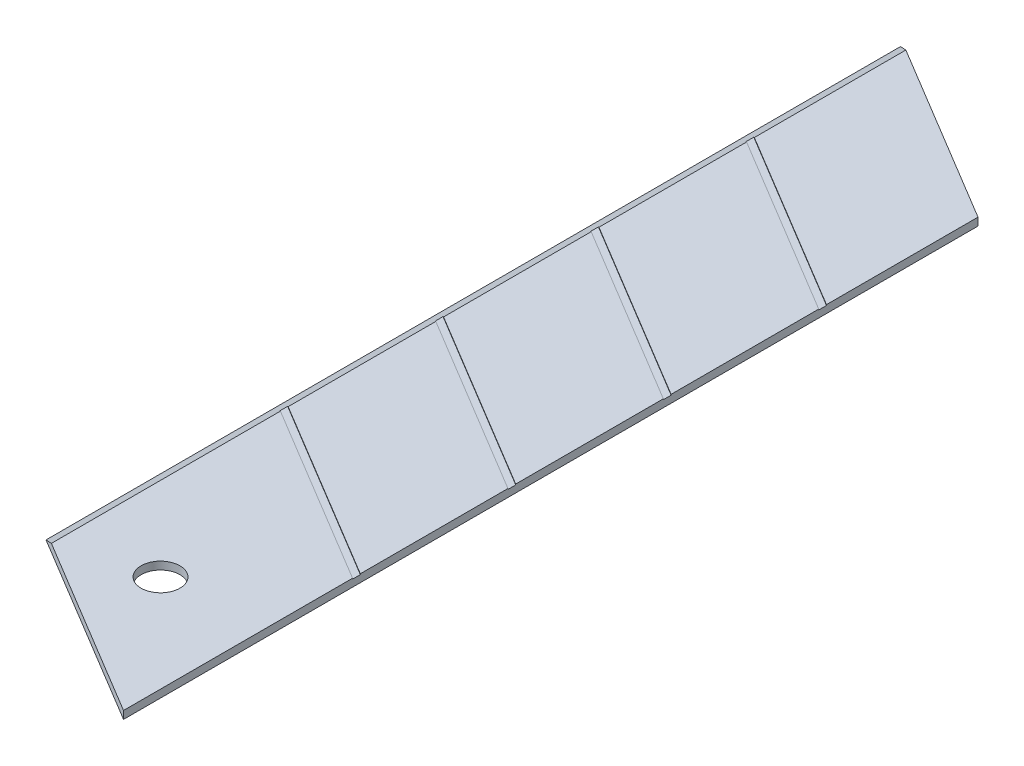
ISO-10303-21;
HEADER;
FILE_DESCRIPTION(('STEP AP214'),'2;1');
FILE_NAME('part.step','',(''),(''),'','','');
FILE_SCHEMA(('AUTOMOTIVE_DESIGN { 1 0 10303 214 1 1 1 1 }'));
ENDSEC;
DATA;
#1=APPLICATION_CONTEXT('core data for automotive mechanical design processes');
#2=APPLICATION_PROTOCOL_DEFINITION('international standard','automotive_design',2000,#1);
#3=PRODUCT_CONTEXT('',#1,'mechanical');
#4=PRODUCT('Part','Part','',(#3));
#5=PRODUCT_RELATED_PRODUCT_CATEGORY('part','',(#4));
#6=PRODUCT_DEFINITION_FORMATION('','',#4);
#7=PRODUCT_DEFINITION_CONTEXT('part definition',#1,'design');
#8=PRODUCT_DEFINITION('design','',#6,#7);
#9=PRODUCT_DEFINITION_SHAPE('','',#8);
#10=(LENGTH_UNIT() NAMED_UNIT(*) SI_UNIT(.MILLI.,.METRE.));
#11=(NAMED_UNIT(*) PLANE_ANGLE_UNIT() SI_UNIT($,.RADIAN.));
#12=(NAMED_UNIT(*) SI_UNIT($,.STERADIAN.) SOLID_ANGLE_UNIT());
#13=UNCERTAINTY_MEASURE_WITH_UNIT(LENGTH_MEASURE(1.E-05),#10,'distance_accuracy_value','');
#14=(GEOMETRIC_REPRESENTATION_CONTEXT(3) GLOBAL_UNCERTAINTY_ASSIGNED_CONTEXT((#13)) GLOBAL_UNIT_ASSIGNED_CONTEXT((#10,
#11,#12)) REPRESENTATION_CONTEXT('',''));
#15=CARTESIAN_POINT('',(0.,0.,0.));
#16=DIRECTION('',(0.,0.,1.));
#17=DIRECTION('',(1.,0.,0.));
#18=AXIS2_PLACEMENT_3D('',#15,#16,#17);
#19=CARTESIAN_POINT('',(12.5,-1.,7.51075773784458));
#20=DIRECTION('',(1.,0.,0.));
#21=DIRECTION('',(0.,0.,-1.));
#22=AXIS2_PLACEMENT_3D('',#19,#20,#21);
#23=PLANE('',#22);
#24=DIRECTION('',(0.,0.,-1.));
#25=VECTOR('',#24,1.);
#26=CARTESIAN_POINT('',(12.5,0.,7.51075773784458));
#27=LINE('',#26,#25);
#28=CARTESIAN_POINT('',(12.5,0.,-22.9677267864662));
#29=VERTEX_POINT('',#28);
#30=CARTESIAN_POINT('',(12.5,0.,-41.9677267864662));
#31=VERTEX_POINT('',#30);
#32=EDGE_CURVE('E270',#29,#31,#27,.T.);
#33=ORIENTED_EDGE('',*,*,#32,.F.);
#34=DIRECTION('',(0.,1.,0.));
#35=VECTOR('',#34,1.);
#36=CARTESIAN_POINT('',(12.5,-0.1,-22.9677267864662));
#37=LINE('',#36,#35);
#38=CARTESIAN_POINT('',(12.5,-0.1,-22.9677267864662));
#39=VERTEX_POINT('',#38);
#40=EDGE_CURVE('E187',#39,#29,#37,.T.);
#41=ORIENTED_EDGE('',*,*,#40,.F.);
#42=DIRECTION('',(0.,0.,-1.));
#43=VECTOR('',#42,1.);
#44=CARTESIAN_POINT('',(12.5,-0.1,0.));
#45=LINE('',#44,#43);
#46=CARTESIAN_POINT('',(12.5,-0.1,-21.9677267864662));
#47=VERTEX_POINT('',#46);
#48=EDGE_CURVE('E173',#47,#39,#45,.T.);
#49=ORIENTED_EDGE('',*,*,#48,.F.);
#50=DIRECTION('',(0.,1.,0.));
#51=VECTOR('',#50,1.);
#52=CARTESIAN_POINT('',(12.5,-0.1,-21.9677267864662));
#53=LINE('',#52,#51);
#54=CARTESIAN_POINT('',(12.5,0.,-21.9677267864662));
#55=VERTEX_POINT('',#54);
#56=EDGE_CURVE('E180',#47,#55,#53,.T.);
#57=ORIENTED_EDGE('',*,*,#56,.T.);
#58=CARTESIAN_POINT('',(12.5,0.,7.51075773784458));
#59=VERTEX_POINT('',#58);
#60=EDGE_CURVE('E268',#59,#55,#27,.T.);
#61=ORIENTED_EDGE('',*,*,#60,.F.);
#62=DIRECTION('',(0.,1.,0.));
#63=VECTOR('',#62,1.);
#64=CARTESIAN_POINT('',(12.5,-1.,7.51075773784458));
#65=LINE('',#64,#63);
#66=CARTESIAN_POINT('',(12.5,-1.,7.51075773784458));
#67=VERTEX_POINT('',#66);
#68=EDGE_CURVE('E265',#67,#59,#65,.T.);
#69=ORIENTED_EDGE('',*,*,#68,.F.);
#70=DIRECTION('',(0.,0.,-1.));
#71=VECTOR('',#70,1.);
#72=CARTESIAN_POINT('',(12.5,-1.,7.51075773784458));
#73=LINE('',#72,#71);
#74=CARTESIAN_POINT('',(12.5,-1.,-102.467726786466));
#75=VERTEX_POINT('',#74);
#76=EDGE_CURVE('E259',#67,#75,#73,.T.);
#77=ORIENTED_EDGE('',*,*,#76,.T.);
#78=DIRECTION('',(0.,1.,0.));
#79=VECTOR('',#78,1.);
#80=CARTESIAN_POINT('',(12.5,-1.,-102.467726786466));
#81=LINE('',#80,#79);
#82=CARTESIAN_POINT('',(12.5,0.,-102.467726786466));
#83=VERTEX_POINT('',#82);
#84=EDGE_CURVE('E274',#75,#83,#81,.T.);
#85=ORIENTED_EDGE('',*,*,#84,.T.);
#86=CARTESIAN_POINT('',(12.5,0.,-82.9677267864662));
#87=VERTEX_POINT('',#86);
#88=EDGE_CURVE('E267',#87,#83,#27,.T.);
#89=ORIENTED_EDGE('',*,*,#88,.F.);
#90=DIRECTION('',(0.,1.,0.));
#91=VECTOR('',#90,1.);
#92=CARTESIAN_POINT('',(12.5,-0.1,-82.9677267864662));
#93=LINE('',#92,#91);
#94=CARTESIAN_POINT('',(12.5,-0.1,-82.9677267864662));
#95=VERTEX_POINT('',#94);
#96=EDGE_CURVE('E212',#95,#87,#93,.T.);
#97=ORIENTED_EDGE('',*,*,#96,.F.);
#98=DIRECTION('',(0.,0.,-1.));
#99=VECTOR('',#98,1.);
#100=CARTESIAN_POINT('',(12.5,-0.1,0.));
#101=LINE('',#100,#99);
#102=CARTESIAN_POINT('',(12.5,-0.1,-81.9677267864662));
#103=VERTEX_POINT('',#102);
#104=EDGE_CURVE('E206',#103,#95,#101,.T.);
#105=ORIENTED_EDGE('',*,*,#104,.F.);
#106=DIRECTION('',(0.,1.,0.));
#107=VECTOR('',#106,1.);
#108=CARTESIAN_POINT('',(12.5,-0.1,-81.9677267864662));
#109=LINE('',#108,#107);
#110=CARTESIAN_POINT('',(12.5,0.,-81.9677267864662));
#111=VERTEX_POINT('',#110);
#112=EDGE_CURVE('E209',#103,#111,#109,.T.);
#113=ORIENTED_EDGE('',*,*,#112,.T.);
#114=CARTESIAN_POINT('',(12.5,0.,-62.9677267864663));
#115=VERTEX_POINT('',#114);
#116=EDGE_CURVE('E340',#115,#111,#27,.T.);
#117=ORIENTED_EDGE('',*,*,#116,.F.);
#118=DIRECTION('',(0.,1.,0.));
#119=VECTOR('',#118,1.);
#120=CARTESIAN_POINT('',(12.5,-0.1,-62.9677267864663));
#121=LINE('',#120,#119);
#122=CARTESIAN_POINT('',(12.5,-0.1,-62.9677267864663));
#123=VERTEX_POINT('',#122);
#124=EDGE_CURVE('E229',#123,#115,#121,.T.);
#125=ORIENTED_EDGE('',*,*,#124,.F.);
#126=DIRECTION('',(0.,0.,-1.));
#127=VECTOR('',#126,1.);
#128=CARTESIAN_POINT('',(12.5,-0.1,0.));
#129=LINE('',#128,#127);
#130=CARTESIAN_POINT('',(12.5,-0.1,-61.9677267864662));
#131=VERTEX_POINT('',#130);
#132=EDGE_CURVE('E220',#131,#123,#129,.T.);
#133=ORIENTED_EDGE('',*,*,#132,.F.);
#134=DIRECTION('',(0.,1.,0.));
#135=VECTOR('',#134,1.);
#136=CARTESIAN_POINT('',(12.5,-0.1,-61.9677267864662));
#137=LINE('',#136,#135);
#138=CARTESIAN_POINT('',(12.5,0.,-61.9677267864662));
#139=VERTEX_POINT('',#138);
#140=EDGE_CURVE('E226',#131,#139,#137,.T.);
#141=ORIENTED_EDGE('',*,*,#140,.T.);
#142=CARTESIAN_POINT('',(12.5,0.,-42.9677267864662));
#143=VERTEX_POINT('',#142);
#144=EDGE_CURVE('E271',#143,#139,#27,.T.);
#145=ORIENTED_EDGE('',*,*,#144,.F.);
#146=DIRECTION('',(0.,1.,0.));
#147=VECTOR('',#146,1.);
#148=CARTESIAN_POINT('',(12.5,-0.1,-42.9677267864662));
#149=LINE('',#148,#147);
#150=CARTESIAN_POINT('',(12.5,-0.1,-42.9677267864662));
#151=VERTEX_POINT('',#150);
#152=EDGE_CURVE('E246',#151,#143,#149,.T.);
#153=ORIENTED_EDGE('',*,*,#152,.F.);
#154=DIRECTION('',(0.,0.,-1.));
#155=VECTOR('',#154,1.);
#156=CARTESIAN_POINT('',(12.5,-0.1,0.));
#157=LINE('',#156,#155);
#158=CARTESIAN_POINT('',(12.5,-0.1,-41.9677267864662));
#159=VERTEX_POINT('',#158);
#160=EDGE_CURVE('E237',#159,#151,#157,.T.);
#161=ORIENTED_EDGE('',*,*,#160,.F.);
#162=DIRECTION('',(0.,1.,0.));
#163=VECTOR('',#162,1.);
#164=CARTESIAN_POINT('',(12.5,-0.1,-41.9677267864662));
#165=LINE('',#164,#163);
#166=EDGE_CURVE('E243',#159,#31,#165,.T.);
#167=ORIENTED_EDGE('',*,*,#166,.T.);
#168=EDGE_LOOP('',(#33,#41,#49,#57,#61,#69,#77,#85,#89,#97,#105,#113,#117,#125,#133,#141,#145,
#153,#161,#167));
#169=FACE_BOUND('',#168,.T.);
#170=ADVANCED_FACE('F35',(#169),#23,.T.);
#171=CARTESIAN_POINT('',(0.,0.,0.));
#172=DIRECTION('',(0.,-1.,0.));
#173=DIRECTION('',(0.,0.,-1.));
#174=AXIS2_PLACEMENT_3D('',#171,#172,#173);
#175=PLANE('',#174);
#176=DIRECTION('',(0.85716730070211,0.,0.515038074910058));
#177=VECTOR('',#176,1.);
#178=CARTESIAN_POINT('',(21.8434544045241,0.,-36.3536129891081));
#179=LINE('',#178,#177);
#180=CARTESIAN_POINT('',(-10.7679491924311,0.,-55.9485211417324));
#181=VERTEX_POINT('',#180);
#182=EDGE_CURVE('E232',#181,#31,#179,.T.);
#183=ORIENTED_EDGE('',*,*,#182,.F.);
#184=DIRECTION('',(0.,0.,1.));
#185=VECTOR('',#184,1.);
#186=CARTESIAN_POINT('',(-10.7679491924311,0.,0.));
#187=LINE('',#186,#185);
#188=CARTESIAN_POINT('',(-10.7679491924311,0.,-36.9485211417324));
#189=VERTEX_POINT('',#188);
#190=EDGE_CURVE('E310',#181,#189,#187,.T.);
#191=ORIENTED_EDGE('',*,*,#190,.T.);
#192=DIRECTION('',(0.85716730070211,0.,0.515038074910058));
#193=VECTOR('',#192,1.);
#194=CARTESIAN_POINT('',(13.4554522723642,0.,-22.3936331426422));
#195=LINE('',#194,#193);
#196=EDGE_CURVE('E177',#189,#29,#195,.T.);
#197=ORIENTED_EDGE('',*,*,#196,.T.);
#198=ORIENTED_EDGE('',*,*,#32,.T.);
#199=EDGE_LOOP('',(#183,#191,#197,#198));
#200=FACE_BOUND('',#199,.T.);
#201=ADVANCED_FACE('F315',(#200),#175,.F.);
#202=DIRECTION('',(-0.85716730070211,0.,-0.515038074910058));
#203=VECTOR('',#202,1.);
#204=CARTESIAN_POINT('',(-12.5,0.,-117.489242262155));
#205=LINE('',#204,#203);
#206=CARTESIAN_POINT('',(-10.7679491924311,0.,-116.448521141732));
#207=VERTEX_POINT('',#206);
#208=EDGE_CURVE('E256',#83,#207,#205,.T.);
#209=ORIENTED_EDGE('',*,*,#208,.T.);
#210=DIRECTION('',(0.,0.,1.));
#211=VECTOR('',#210,1.);
#212=CARTESIAN_POINT('',(-10.7679491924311,0.,0.));
#213=LINE('',#212,#211);
#214=CARTESIAN_POINT('',(-10.7679491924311,0.,-96.9485211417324));
#215=VERTEX_POINT('',#214);
#216=EDGE_CURVE('E286',#207,#215,#213,.T.);
#217=ORIENTED_EDGE('',*,*,#216,.T.);
#218=DIRECTION('',(0.85716730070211,0.,0.515038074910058));
#219=VECTOR('',#218,1.);
#220=CARTESIAN_POINT('',(39.9438800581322,0.,-66.4777800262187));
#221=LINE('',#220,#219);
#222=EDGE_CURVE('E199',#215,#87,#221,.T.);
#223=ORIENTED_EDGE('',*,*,#222,.T.);
#224=ORIENTED_EDGE('',*,*,#88,.T.);
#225=EDGE_LOOP('',(#209,#217,#223,#224));
#226=FACE_BOUND('',#225,.T.);
#227=ADVANCED_FACE('F386',(#226),#175,.F.);
#228=DIRECTION('',(0.85716730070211,0.,0.515038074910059));
#229=VECTOR('',#228,1.);
#230=CARTESIAN_POINT('',(39.5024062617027,0.,-65.7430442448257));
#231=LINE('',#230,#229);
#232=CARTESIAN_POINT('',(-10.7679491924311,0.,-95.9485211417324));
#233=VERTEX_POINT('',#232);
#234=EDGE_CURVE('E204',#233,#111,#231,.T.);
#235=ORIENTED_EDGE('',*,*,#234,.F.);
#236=DIRECTION('',(0.,0.,1.));
#237=VECTOR('',#236,1.);
#238=CARTESIAN_POINT('',(-10.7679491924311,0.,0.));
#239=LINE('',#238,#237);
#240=CARTESIAN_POINT('',(-10.7679491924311,0.,-76.9485211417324));
#241=VERTEX_POINT('',#240);
#242=EDGE_CURVE('E294',#233,#241,#239,.T.);
#243=ORIENTED_EDGE('',*,*,#242,.T.);
#244=DIRECTION('',(0.85716730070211,0.,0.515038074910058));
#245=VECTOR('',#244,1.);
#246=CARTESIAN_POINT('',(31.1144041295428,0.,-51.7830643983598));
#247=LINE('',#246,#245);
#248=EDGE_CURVE('E221',#241,#115,#247,.T.);
#249=ORIENTED_EDGE('',*,*,#248,.T.);
#250=ORIENTED_EDGE('',*,*,#116,.T.);
#251=EDGE_LOOP('',(#235,#243,#249,#250));
#252=FACE_BOUND('',#251,.T.);
#253=ADVANCED_FACE('F398',(#252),#175,.F.);
#254=DIRECTION('',(0.85716730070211,0.,0.515038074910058));
#255=VECTOR('',#254,1.);
#256=CARTESIAN_POINT('',(30.6729303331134,0.,-51.0483286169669));
#257=LINE('',#256,#255);
#258=CARTESIAN_POINT('',(-10.7679491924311,0.,-75.9485211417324));
#259=VERTEX_POINT('',#258);
#260=EDGE_CURVE('E215',#259,#139,#257,.T.);
#261=ORIENTED_EDGE('',*,*,#260,.F.);
#262=DIRECTION('',(0.,0.,1.));
#263=VECTOR('',#262,1.);
#264=CARTESIAN_POINT('',(-10.7679491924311,0.,0.));
#265=LINE('',#264,#263);
#266=CARTESIAN_POINT('',(-10.7679491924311,0.,-56.9485211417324));
#267=VERTEX_POINT('',#266);
#268=EDGE_CURVE('E302',#259,#267,#265,.T.);
#269=ORIENTED_EDGE('',*,*,#268,.T.);
#270=DIRECTION('',(0.85716730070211,0.,0.515038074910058));
#271=VECTOR('',#270,1.);
#272=CARTESIAN_POINT('',(22.2849282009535,0.,-37.088348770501));
#273=LINE('',#272,#271);
#274=EDGE_CURVE('E238',#267,#143,#273,.T.);
#275=ORIENTED_EDGE('',*,*,#274,.T.);
#276=ORIENTED_EDGE('',*,*,#144,.T.);
#277=EDGE_LOOP('',(#261,#269,#275,#276));
#278=FACE_BOUND('',#277,.T.);
#279=ADVANCED_FACE('F346',(#278),#175,.F.);
#280=CARTESIAN_POINT('',(-12.5,-1.,-117.489242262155));
#281=DIRECTION('',(0.515038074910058,0.,-0.85716730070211));
#282=DIRECTION('',(-0.85716730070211,0.,-0.515038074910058));
#283=AXIS2_PLACEMENT_3D('',#280,#281,#282);
#284=PLANE('',#283);
#285=DIRECTION('',(-0.85716730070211,0.,-0.515038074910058));
#286=VECTOR('',#285,1.);
#287=CARTESIAN_POINT('',(-12.5,-1.,-117.489242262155));
#288=LINE('',#287,#286);
#289=CARTESIAN_POINT('',(-12.5,-1.,-117.489242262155));
#290=VERTEX_POINT('',#289);
#291=EDGE_CURVE('E262',#75,#290,#288,.T.);
#292=ORIENTED_EDGE('',*,*,#291,.T.);
#293=DIRECTION('',(0.768238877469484,0.443542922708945,0.461604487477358));
#294=VECTOR('',#293,1.);
#295=CARTESIAN_POINT('',(-12.5,-1.,-117.489242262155));
#296=LINE('',#295,#294);
#297=EDGE_CURVE('E284',#290,#207,#296,.T.);
#298=ORIENTED_EDGE('',*,*,#297,.T.);
#299=ORIENTED_EDGE('',*,*,#208,.F.);
#300=ORIENTED_EDGE('',*,*,#84,.F.);
#301=EDGE_LOOP('',(#292,#298,#299,#300));
#302=FACE_BOUND('',#301,.T.);
#303=ADVANCED_FACE('F334',(#302),#284,.T.);
#304=CARTESIAN_POINT('',(-12.5,-1.,-7.51075773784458));
#305=DIRECTION('',(-0.515038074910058,0.,0.85716730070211));
#306=DIRECTION('',(0.85716730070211,0.,0.515038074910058));
#307=AXIS2_PLACEMENT_3D('',#304,#305,#306);
#308=PLANE('',#307);
#309=DIRECTION('',(0.85716730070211,0.,0.515038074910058));
#310=VECTOR('',#309,1.);
#311=CARTESIAN_POINT('',(-12.5,0.,-7.51075773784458));
#312=LINE('',#311,#310);
#313=CARTESIAN_POINT('',(-10.7679491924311,0.,-6.47003661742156));
#314=VERTEX_POINT('',#313);
#315=EDGE_CURVE('E249',#314,#59,#312,.T.);
#316=ORIENTED_EDGE('',*,*,#315,.F.);
#317=DIRECTION('',(-0.768238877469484,-0.443542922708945,-0.461604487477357));
#318=VECTOR('',#317,1.);
#319=CARTESIAN_POINT('',(-12.5,-1.,-7.51075773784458));
#320=LINE('',#319,#318);
#321=CARTESIAN_POINT('',(-12.5,-1.,-7.51075773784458));
#322=VERTEX_POINT('',#321);
#323=EDGE_CURVE('E282',#314,#322,#320,.T.);
#324=ORIENTED_EDGE('',*,*,#323,.T.);
#325=DIRECTION('',(0.85716730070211,0.,0.515038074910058));
#326=VECTOR('',#325,1.);
#327=CARTESIAN_POINT('',(-12.5,-1.,-7.51075773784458));
#328=LINE('',#327,#326);
#329=EDGE_CURVE('E255',#322,#67,#328,.T.);
#330=ORIENTED_EDGE('',*,*,#329,.T.);
#331=ORIENTED_EDGE('',*,*,#68,.T.);
#332=EDGE_LOOP('',(#316,#324,#330,#331));
#333=FACE_BOUND('',#332,.T.);
#334=ADVANCED_FACE('F331',(#333),#308,.T.);
#335=CARTESIAN_POINT('',(0.,-1.,0.));
#336=DIRECTION('',(0.,-1.,0.));
#337=DIRECTION('',(0.,0.,-1.));
#338=AXIS2_PLACEMENT_3D('',#335,#336,#337);
#339=PLANE('',#338);
#340=CARTESIAN_POINT('',(0.,-1.,-9.75));
#341=DIRECTION('',(0.,1.,0.));
#342=DIRECTION('',(0.,0.,1.));
#343=AXIS2_PLACEMENT_3D('',#340,#341,#342);
#344=CIRCLE('',#343,2.5);
#345=CARTESIAN_POINT('',(0.,-1.,-7.25));
#346=VERTEX_POINT('',#345);
#347=EDGE_CURVE('E197',#346,#346,#344,.T.);
#348=ORIENTED_EDGE('',*,*,#347,.T.);
#349=EDGE_LOOP('',(#348));
#350=FACE_BOUND('',#349,.T.);
#351=DIRECTION('',(0.,0.,1.));
#352=VECTOR('',#351,1.);
#353=CARTESIAN_POINT('',(-12.5,-1.,-7.51075773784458));
#354=LINE('',#353,#352);
#355=EDGE_CURVE('E252',#290,#322,#354,.T.);
#356=ORIENTED_EDGE('',*,*,#355,.F.);
#357=ORIENTED_EDGE('',*,*,#291,.F.);
#358=ORIENTED_EDGE('',*,*,#76,.F.);
#359=ORIENTED_EDGE('',*,*,#329,.F.);
#360=EDGE_LOOP('',(#356,#357,#358,#359));
#361=FACE_BOUND('',#360,.T.);
#362=ADVANCED_FACE('F330',(#350,#361),#339,.T.);
#363=CARTESIAN_POINT('',(0.,0.,-9.75));
#364=DIRECTION('',(0.,1.,0.));
#365=DIRECTION('',(0.,0.,1.));
#366=AXIS2_PLACEMENT_3D('',#363,#364,#365);
#367=CIRCLE('',#366,2.5);
#368=CARTESIAN_POINT('',(0.,0.,-7.25));
#369=VERTEX_POINT('',#368);
#370=EDGE_CURVE('E409',#369,#369,#367,.T.);
#371=ORIENTED_EDGE('',*,*,#370,.F.);
#372=EDGE_LOOP('',(#371));
#373=FACE_BOUND('',#372,.T.);
#374=DIRECTION('',(0.85716730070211,0.,0.515038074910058));
#375=VECTOR('',#374,1.);
#376=CARTESIAN_POINT('',(13.0139784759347,0.,-21.6588973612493));
#377=LINE('',#376,#375);
#378=CARTESIAN_POINT('',(-10.7679491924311,0.,-35.9485211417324));
#379=VERTEX_POINT('',#378);
#380=EDGE_CURVE('E183',#379,#55,#377,.T.);
#381=ORIENTED_EDGE('',*,*,#380,.F.);
#382=DIRECTION('',(0.,0.,1.));
#383=VECTOR('',#382,1.);
#384=CARTESIAN_POINT('',(-10.7679491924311,0.,-7.51075773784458));
#385=LINE('',#384,#383);
#386=EDGE_CURVE('E277',#379,#314,#385,.T.);
#387=ORIENTED_EDGE('',*,*,#386,.T.);
#388=ORIENTED_EDGE('',*,*,#315,.T.);
#389=ORIENTED_EDGE('',*,*,#60,.T.);
#390=EDGE_LOOP('',(#381,#387,#388,#389));
#391=FACE_BOUND('',#390,.T.);
#392=ADVANCED_FACE('F323',(#373,#391),#175,.F.);
#393=CARTESIAN_POINT('',(22.2849282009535,-0.1,-37.088348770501));
#394=DIRECTION('',(-0.515038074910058,0.,0.85716730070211));
#395=DIRECTION('',(0.85716730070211,0.,0.515038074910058));
#396=AXIS2_PLACEMENT_3D('',#393,#394,#395);
#397=PLANE('',#396);
#398=ORIENTED_EDGE('',*,*,#274,.F.);
#399=DIRECTION('',(-0.768238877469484,-0.443542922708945,-0.461604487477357));
#400=VECTOR('',#399,1.);
#401=CARTESIAN_POINT('',(15.7483502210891,15.3091926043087,-41.0159210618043));
#402=LINE('',#401,#400);
#403=CARTESIAN_POINT('',(-10.941154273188,-0.1,-57.0525932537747));
#404=VERTEX_POINT('',#403);
#405=EDGE_CURVE('E304',#267,#404,#402,.T.);
#406=ORIENTED_EDGE('',*,*,#405,.T.);
#407=DIRECTION('',(0.85716730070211,0.,0.515038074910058));
#408=VECTOR('',#407,1.);
#409=CARTESIAN_POINT('',(22.2849282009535,-0.1,-37.088348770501));
#410=LINE('',#409,#408);
#411=EDGE_CURVE('E241',#404,#151,#410,.T.);
#412=ORIENTED_EDGE('',*,*,#411,.T.);
#413=ORIENTED_EDGE('',*,*,#152,.T.);
#414=EDGE_LOOP('',(#398,#406,#412,#413));
#415=FACE_BOUND('',#414,.T.);
#416=ADVANCED_FACE('F363',(#415),#397,.T.);
#417=CARTESIAN_POINT('',(21.8434544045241,-0.1,-36.3536129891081));
#418=DIRECTION('',(-0.515038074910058,0.,0.85716730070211));
#419=DIRECTION('',(0.85716730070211,0.,0.515038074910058));
#420=AXIS2_PLACEMENT_3D('',#417,#418,#419);
#421=PLANE('',#420);
#422=DIRECTION('',(0.85716730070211,0.,0.515038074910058));
#423=VECTOR('',#422,1.);
#424=CARTESIAN_POINT('',(21.8434544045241,-0.1,-36.3536129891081));
#425=LINE('',#424,#423);
#426=CARTESIAN_POINT('',(-10.941154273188,-0.0999999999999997,-56.0525932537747));
#427=VERTEX_POINT('',#426);
#428=EDGE_CURVE('E235',#427,#159,#425,.T.);
#429=ORIENTED_EDGE('',*,*,#428,.F.);
#430=DIRECTION('',(0.768238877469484,0.443542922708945,0.461604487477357));
#431=VECTOR('',#430,1.);
#432=CARTESIAN_POINT('',(9.07265598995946,11.4549787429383,-44.0270828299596));
#433=LINE('',#432,#431);
#434=EDGE_CURVE('E308',#427,#181,#433,.T.);
#435=ORIENTED_EDGE('',*,*,#434,.T.);
#436=ORIENTED_EDGE('',*,*,#182,.T.);
#437=ORIENTED_EDGE('',*,*,#166,.F.);
#438=EDGE_LOOP('',(#429,#435,#436,#437));
#439=FACE_BOUND('',#438,.T.);
#440=ADVANCED_FACE('F370',(#439),#421,.F.);
#441=CARTESIAN_POINT('',(0.,-0.1,0.));
#442=DIRECTION('',(0.,1.,0.));
#443=DIRECTION('',(0.,0.,1.));
#444=AXIS2_PLACEMENT_3D('',#441,#442,#443);
#445=PLANE('',#444);
#446=ORIENTED_EDGE('',*,*,#411,.F.);
#447=DIRECTION('',(0.,0.,1.));
#448=VECTOR('',#447,1.);
#449=CARTESIAN_POINT('',(-10.941154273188,-0.1,0.));
#450=LINE('',#449,#448);
#451=EDGE_CURVE('E306',#404,#427,#450,.T.);
#452=ORIENTED_EDGE('',*,*,#451,.T.);
#453=ORIENTED_EDGE('',*,*,#428,.T.);
#454=ORIENTED_EDGE('',*,*,#160,.T.);
#455=EDGE_LOOP('',(#446,#452,#453,#454));
#456=FACE_BOUND('',#455,.T.);
#457=ADVANCED_FACE('F366',(#456),#445,.T.);
#458=CARTESIAN_POINT('',(31.1144041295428,-0.1,-51.7830643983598));
#459=DIRECTION('',(-0.515038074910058,0.,0.85716730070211));
#460=DIRECTION('',(0.85716730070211,0.,0.515038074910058));
#461=AXIS2_PLACEMENT_3D('',#458,#459,#460);
#462=PLANE('',#461);
#463=ORIENTED_EDGE('',*,*,#248,.F.);
#464=DIRECTION('',(-0.768238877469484,-0.443542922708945,-0.461604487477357));
#465=VECTOR('',#464,1.);
#466=CARTESIAN_POINT('',(22.8408004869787,19.4040206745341,-56.7543470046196));
#467=LINE('',#466,#465);
#468=CARTESIAN_POINT('',(-10.941154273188,-0.1,-77.0525932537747));
#469=VERTEX_POINT('',#468);
#470=EDGE_CURVE('E296',#241,#469,#467,.T.);
#471=ORIENTED_EDGE('',*,*,#470,.T.);
#472=DIRECTION('',(0.85716730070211,0.,0.515038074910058));
#473=VECTOR('',#472,1.);
#474=CARTESIAN_POINT('',(31.1144041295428,-0.1,-51.7830643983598));
#475=LINE('',#474,#473);
#476=EDGE_CURVE('E224',#469,#123,#475,.T.);
#477=ORIENTED_EDGE('',*,*,#476,.T.);
#478=ORIENTED_EDGE('',*,*,#124,.T.);
#479=EDGE_LOOP('',(#463,#471,#477,#478));
#480=FACE_BOUND('',#479,.T.);
#481=ADVANCED_FACE('F377',(#480),#462,.T.);
#482=CARTESIAN_POINT('',(30.6729303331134,-0.1,-51.0483286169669));
#483=DIRECTION('',(-0.515038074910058,0.,0.85716730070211));
#484=DIRECTION('',(0.85716730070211,0.,0.515038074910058));
#485=AXIS2_PLACEMENT_3D('',#482,#483,#484);
#486=PLANE('',#485);
#487=DIRECTION('',(0.85716730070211,0.,0.515038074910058));
#488=VECTOR('',#487,1.);
#489=CARTESIAN_POINT('',(30.6729303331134,-0.1,-51.0483286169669));
#490=LINE('',#489,#488);
#491=CARTESIAN_POINT('',(-10.941154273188,-0.100000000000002,-76.0525932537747));
#492=VERTEX_POINT('',#491);
#493=EDGE_CURVE('E218',#492,#131,#490,.T.);
#494=ORIENTED_EDGE('',*,*,#493,.F.);
#495=DIRECTION('',(0.768238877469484,0.443542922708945,0.461604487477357));
#496=VECTOR('',#495,1.);
#497=CARTESIAN_POINT('',(16.1651062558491,15.5498068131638,-59.7655087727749));
#498=LINE('',#497,#496);
#499=EDGE_CURVE('E300',#492,#259,#498,.T.);
#500=ORIENTED_EDGE('',*,*,#499,.T.);
#501=ORIENTED_EDGE('',*,*,#260,.T.);
#502=ORIENTED_EDGE('',*,*,#140,.F.);
#503=EDGE_LOOP('',(#494,#500,#501,#502));
#504=FACE_BOUND('',#503,.T.);
#505=ADVANCED_FACE('F356',(#504),#486,.F.);
#506=CARTESIAN_POINT('',(0.,-0.1,0.));
#507=DIRECTION('',(0.,1.,0.));
#508=DIRECTION('',(0.,0.,1.));
#509=AXIS2_PLACEMENT_3D('',#506,#507,#508);
#510=PLANE('',#509);
#511=ORIENTED_EDGE('',*,*,#476,.F.);
#512=DIRECTION('',(0.,0.,1.));
#513=VECTOR('',#512,1.);
#514=CARTESIAN_POINT('',(-10.941154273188,-0.1,0.));
#515=LINE('',#514,#513);
#516=EDGE_CURVE('E298',#469,#492,#515,.T.);
#517=ORIENTED_EDGE('',*,*,#516,.T.);
#518=ORIENTED_EDGE('',*,*,#493,.T.);
#519=ORIENTED_EDGE('',*,*,#132,.T.);
#520=EDGE_LOOP('',(#511,#517,#518,#519));
#521=FACE_BOUND('',#520,.T.);
#522=ADVANCED_FACE('F439',(#521),#510,.T.);
#523=CARTESIAN_POINT('',(39.9438800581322,-0.1,-66.4777800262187));
#524=DIRECTION('',(-0.515038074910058,0.,0.85716730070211));
#525=DIRECTION('',(0.85716730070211,0.,0.515038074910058));
#526=AXIS2_PLACEMENT_3D('',#523,#524,#525);
#527=PLANE('',#526);
#528=ORIENTED_EDGE('',*,*,#222,.F.);
#529=DIRECTION('',(-0.768238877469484,-0.443542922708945,-0.461604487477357));
#530=VECTOR('',#529,1.);
#531=CARTESIAN_POINT('',(29.9332507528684,23.4988487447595,-72.492772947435));
#532=LINE('',#531,#530);
#533=CARTESIAN_POINT('',(-10.941154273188,-0.1,-97.0525932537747));
#534=VERTEX_POINT('',#533);
#535=EDGE_CURVE('E288',#215,#534,#532,.T.);
#536=ORIENTED_EDGE('',*,*,#535,.T.);
#537=DIRECTION('',(0.85716730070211,0.,0.515038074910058));
#538=VECTOR('',#537,1.);
#539=CARTESIAN_POINT('',(39.9438800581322,-0.1,-66.4777800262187));
#540=LINE('',#539,#538);
#541=EDGE_CURVE('E201',#534,#95,#540,.T.);
#542=ORIENTED_EDGE('',*,*,#541,.T.);
#543=ORIENTED_EDGE('',*,*,#96,.T.);
#544=EDGE_LOOP('',(#528,#536,#542,#543));
#545=FACE_BOUND('',#544,.T.);
#546=ADVANCED_FACE('F435',(#545),#527,.T.);
#547=CARTESIAN_POINT('',(39.5024062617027,-0.1,-65.7430442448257));
#548=DIRECTION('',(-0.515038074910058,0.,0.85716730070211));
#549=DIRECTION('',(0.85716730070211,0.,0.515038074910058));
#550=AXIS2_PLACEMENT_3D('',#547,#548,#549);
#551=PLANE('',#550);
#552=DIRECTION('',(0.85716730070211,0.,0.515038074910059));
#553=VECTOR('',#552,1.);
#554=CARTESIAN_POINT('',(39.5024062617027,-0.1,-65.7430442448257));
#555=LINE('',#554,#553);
#556=CARTESIAN_POINT('',(-10.941154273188,-0.099999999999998,-96.0525932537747));
#557=VERTEX_POINT('',#556);
#558=EDGE_CURVE('E203',#557,#103,#555,.T.);
#559=ORIENTED_EDGE('',*,*,#558,.F.);
#560=DIRECTION('',(0.768238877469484,0.443542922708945,0.461604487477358));
#561=VECTOR('',#560,1.);
#562=CARTESIAN_POINT('',(23.2575565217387,19.6446348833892,-75.5039347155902));
#563=LINE('',#562,#561);
#564=EDGE_CURVE('E292',#557,#233,#563,.T.);
#565=ORIENTED_EDGE('',*,*,#564,.T.);
#566=ORIENTED_EDGE('',*,*,#234,.T.);
#567=ORIENTED_EDGE('',*,*,#112,.F.);
#568=EDGE_LOOP('',(#559,#565,#566,#567));
#569=FACE_BOUND('',#568,.T.);
#570=ADVANCED_FACE('F431',(#569),#551,.F.);
#571=CARTESIAN_POINT('',(0.,-0.1,0.));
#572=DIRECTION('',(0.,1.,0.));
#573=DIRECTION('',(0.,0.,1.));
#574=AXIS2_PLACEMENT_3D('',#571,#572,#573);
#575=PLANE('',#574);
#576=ORIENTED_EDGE('',*,*,#541,.F.);
#577=DIRECTION('',(0.,0.,1.));
#578=VECTOR('',#577,1.);
#579=CARTESIAN_POINT('',(-10.941154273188,-0.1,0.));
#580=LINE('',#579,#578);
#581=EDGE_CURVE('E290',#534,#557,#580,.T.);
#582=ORIENTED_EDGE('',*,*,#581,.T.);
#583=ORIENTED_EDGE('',*,*,#558,.T.);
#584=ORIENTED_EDGE('',*,*,#104,.T.);
#585=EDGE_LOOP('',(#576,#582,#583,#584));
#586=FACE_BOUND('',#585,.T.);
#587=ADVANCED_FACE('F426',(#586),#575,.T.);
#588=CARTESIAN_POINT('',(13.4554522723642,-0.1,-22.3936331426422));
#589=DIRECTION('',(-0.515038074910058,0.,0.85716730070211));
#590=DIRECTION('',(0.85716730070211,0.,0.515038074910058));
#591=AXIS2_PLACEMENT_3D('',#588,#589,#590);
#592=PLANE('',#591);
#593=ORIENTED_EDGE('',*,*,#196,.F.);
#594=DIRECTION('',(-0.768238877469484,-0.443542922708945,-0.461604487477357));
#595=VECTOR('',#594,1.);
#596=CARTESIAN_POINT('',(8.65589995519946,11.2143645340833,-25.277495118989));
#597=LINE('',#596,#595);
#598=CARTESIAN_POINT('',(-10.941154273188,-0.1,-37.0525932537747));
#599=VERTEX_POINT('',#598);
#600=EDGE_CURVE('E57',#189,#599,#597,.T.);
#601=ORIENTED_EDGE('',*,*,#600,.T.);
#602=DIRECTION('',(0.85716730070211,0.,0.515038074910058));
#603=VECTOR('',#602,1.);
#604=CARTESIAN_POINT('',(13.4554522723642,-0.1,-22.3936331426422));
#605=LINE('',#604,#603);
#606=EDGE_CURVE('E188',#599,#39,#605,.T.);
#607=ORIENTED_EDGE('',*,*,#606,.T.);
#608=ORIENTED_EDGE('',*,*,#40,.T.);
#609=EDGE_LOOP('',(#593,#601,#607,#608));
#610=FACE_BOUND('',#609,.T.);
#611=ADVANCED_FACE('F319',(#610),#592,.T.);
#612=CARTESIAN_POINT('',(13.0139784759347,-0.1,-21.6588973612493));
#613=DIRECTION('',(-0.515038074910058,0.,0.85716730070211));
#614=DIRECTION('',(0.85716730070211,0.,0.515038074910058));
#615=AXIS2_PLACEMENT_3D('',#612,#613,#614);
#616=PLANE('',#615);
#617=DIRECTION('',(0.85716730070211,0.,0.515038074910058));
#618=VECTOR('',#617,1.);
#619=CARTESIAN_POINT('',(13.0139784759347,-0.1,-21.6588973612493));
#620=LINE('',#619,#618);
#621=CARTESIAN_POINT('',(-10.941154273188,-0.0999999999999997,-36.0525932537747));
#622=VERTEX_POINT('',#621);
#623=EDGE_CURVE('E169',#622,#47,#620,.T.);
#624=ORIENTED_EDGE('',*,*,#623,.F.);
#625=DIRECTION('',(0.768238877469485,0.443542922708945,0.461604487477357));
#626=VECTOR('',#625,1.);
#627=CARTESIAN_POINT('',(1.9802057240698,7.36015067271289,-28.2886568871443));
#628=LINE('',#627,#626);
#629=EDGE_CURVE('E11',#622,#379,#628,.T.);
#630=ORIENTED_EDGE('',*,*,#629,.T.);
#631=ORIENTED_EDGE('',*,*,#380,.T.);
#632=ORIENTED_EDGE('',*,*,#56,.F.);
#633=EDGE_LOOP('',(#624,#630,#631,#632));
#634=FACE_BOUND('',#633,.T.);
#635=ADVANCED_FACE('F181',(#634),#616,.F.);
#636=CARTESIAN_POINT('',(0.,-0.1,0.));
#637=DIRECTION('',(0.,1.,0.));
#638=DIRECTION('',(0.,0.,1.));
#639=AXIS2_PLACEMENT_3D('',#636,#637,#638);
#640=PLANE('',#639);
#641=ORIENTED_EDGE('',*,*,#606,.F.);
#642=DIRECTION('',(0.,0.,1.));
#643=VECTOR('',#642,1.);
#644=CARTESIAN_POINT('',(-10.941154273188,-0.1,0.));
#645=LINE('',#644,#643);
#646=EDGE_CURVE('E43',#599,#622,#645,.T.);
#647=ORIENTED_EDGE('',*,*,#646,.T.);
#648=ORIENTED_EDGE('',*,*,#623,.T.);
#649=ORIENTED_EDGE('',*,*,#48,.T.);
#650=EDGE_LOOP('',(#641,#647,#648,#649));
#651=FACE_BOUND('',#650,.T.);
#652=ADVANCED_FACE('F171',(#651),#640,.T.);
#653=CARTESIAN_POINT('',(0.,-1.,-9.75));
#654=DIRECTION('',(0.,1.,0.));
#655=DIRECTION('',(0.,0.,1.));
#656=AXIS2_PLACEMENT_3D('',#653,#654,#655);
#657=CYLINDRICAL_SURFACE('',#656,2.5);
#658=ORIENTED_EDGE('',*,*,#347,.F.);
#659=EDGE_LOOP('',(#658));
#660=FACE_BOUND('',#659,.T.);
#661=ORIENTED_EDGE('',*,*,#370,.T.);
#662=EDGE_LOOP('',(#661));
#663=FACE_BOUND('',#662,.T.);
#664=ADVANCED_FACE('F415',(#660,#663),#657,.F.);
#665=CARTESIAN_POINT('',(-10.7679491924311,0.,0.));
#666=DIRECTION('',(-0.500000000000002,0.866025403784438,0.));
#667=DIRECTION('',(0.,0.,-1.));
#668=AXIS2_PLACEMENT_3D('',#665,#666,#667);
#669=PLANE('',#668);
#670=ORIENTED_EDGE('',*,*,#297,.F.);
#671=ORIENTED_EDGE('',*,*,#355,.T.);
#672=ORIENTED_EDGE('',*,*,#323,.F.);
#673=ORIENTED_EDGE('',*,*,#386,.F.);
#674=ORIENTED_EDGE('',*,*,#629,.F.);
#675=ORIENTED_EDGE('',*,*,#646,.F.);
#676=ORIENTED_EDGE('',*,*,#600,.F.);
#677=ORIENTED_EDGE('',*,*,#190,.F.);
#678=ORIENTED_EDGE('',*,*,#434,.F.);
#679=ORIENTED_EDGE('',*,*,#451,.F.);
#680=ORIENTED_EDGE('',*,*,#405,.F.);
#681=ORIENTED_EDGE('',*,*,#268,.F.);
#682=ORIENTED_EDGE('',*,*,#499,.F.);
#683=ORIENTED_EDGE('',*,*,#516,.F.);
#684=ORIENTED_EDGE('',*,*,#470,.F.);
#685=ORIENTED_EDGE('',*,*,#242,.F.);
#686=ORIENTED_EDGE('',*,*,#564,.F.);
#687=ORIENTED_EDGE('',*,*,#581,.F.);
#688=ORIENTED_EDGE('',*,*,#535,.F.);
#689=ORIENTED_EDGE('',*,*,#216,.F.);
#690=EDGE_LOOP('',(#670,#671,#672,#673,#674,#675,#676,#677,#678,#679,#680,#681,#682,#683,#684,
#685,#686,#687,#688,#689));
#691=FACE_BOUND('',#690,.T.);
#692=ADVANCED_FACE('F37',(#691),#669,.T.);
#693=CLOSED_SHELL('',(#170,#201,#227,#253,#279,#303,#334,#362,#392,#416,#440,#457,#481,#505,
#522,#546,#570,#587,#611,#635,#652,#664,#692));
#694=MANIFOLD_SOLID_BREP('B2',#693);
#695=ADVANCED_BREP_SHAPE_REPRESENTATION('',(#18,#694),#14);
#696=SHAPE_DEFINITION_REPRESENTATION(#9,#695);
ENDSEC;
END-ISO-10303-21;
